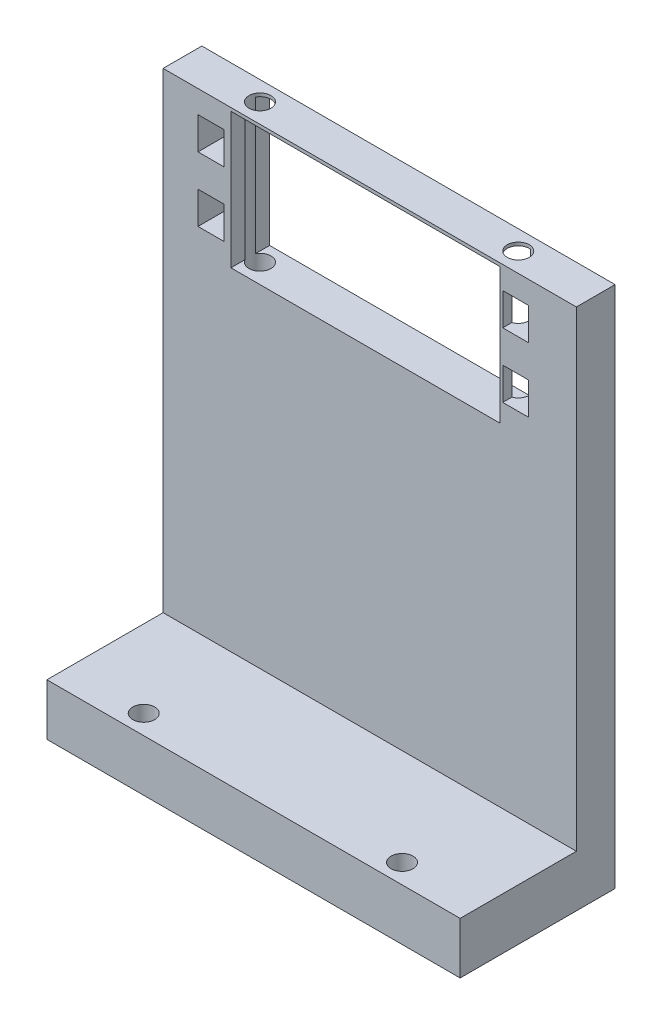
from build123d import *

# Parameters (mm, degrees)
SKETCH_1_W                                      = 64
SKETCH_1_H                                      = 8
SERVO_FOOT_DEPTH                                = 24
SKETCH_2_W                                      = 64
SKETCH_2_H                                      = 81
SERVO_FACE_PLATE_DEPTH                          = 6
MG995_BODY_WINDOW_REFERENCE_DEPTH               = 95.794514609
MG995_BODY_WINDOW_REFERENCE_DEPTH_BACK          = 95.794514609
SKETCH_3_W                                      = 41.7
SKETCH_3_H                                      = 21
MG995_47P2X10_REFERENCE_SLOTS_VERIFY_DEPTH      = 95.794514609
MG995_47P2X10_REFERENCE_SLOTS_VERIFY_DEPTH_BACK = 95.794514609
SKETCH_4_W                                      = 4
SKETCH_4_H                                      = 5
SERVO_FOOT_M3_DEPTH                             = 95.794514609
SERVO_FOOT_M3_DEPTH_BACK                        = 95.794514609
SKETCH_5_R                                      = 1.7


with BuildPart() as part:
    # Sketch 1 → Servo_foot (new body)
    with BuildSketch(Plane.XY):
        with Locations((11, 4)):
            Rectangle(SKETCH_1_W, SKETCH_1_H)
    extrude(amount=SERVO_FOOT_DEPTH)

    # Sketch 2 → Servo_face_plate (add)
    with BuildSketch(Plane.XY):
        with Locations((11, 40.5)):
            Rectangle(SKETCH_2_W, SKETCH_2_H)
    extrude(amount=SERVO_FACE_PLATE_DEPTH)

    # Sketch 3 → MG995_body_window_REFERENCE (cut, two sides: drawn at the far end of the back side and taken through both)
    with BuildSketch(Plane.XY.offset(-MG995_BODY_WINDOW_REFERENCE_DEPTH_BACK)):
        with Locations((10.35, 70)):
            Rectangle(SKETCH_3_W, SKETCH_3_H)
    extrude(amount=MG995_BODY_WINDOW_REFERENCE_DEPTH + MG995_BODY_WINDOW_REFERENCE_DEPTH_BACK, mode=Mode.SUBTRACT)

    # Sketch 4 → MG995_47p2x10_reference_slots_VERIFY (cut, two sides: drawn at the far end of the back side and taken through both)
    with BuildSketch(Plane.XY.offset(-MG995_47P2X10_REFERENCE_SLOTS_VERIFY_DEPTH_BACK)):
        with Locations((-13.6, 65)):
            Rectangle(SKETCH_4_W, SKETCH_4_H)
        with Locations((-13.6, 75)):
            Rectangle(SKETCH_4_W, SKETCH_4_H)
        with Locations((33.6, 65)):
            Rectangle(SKETCH_4_W, SKETCH_4_H)
        with Locations((33.6, 75)):
            Rectangle(SKETCH_4_W, SKETCH_4_H)
    extrude(amount=MG995_47P2X10_REFERENCE_SLOTS_VERIFY_DEPTH + MG995_47P2X10_REFERENCE_SLOTS_VERIFY_DEPTH_BACK, mode=Mode.SUBTRACT)

    # Sketch 5 → Servo_foot_M3 (cut, two sides: drawn at the far end of the back side and taken through both)
    with BuildSketch(Plane(origin=(0, 0, 0), x_dir=(1, 0, 0), z_dir=(0, 1, 0)).offset(-SERVO_FOOT_M3_DEPTH_BACK)):
        with Locations(Location((-9, -3, 0), (0, 0, 270))):
            Circle(SKETCH_5_R)
        with Locations(Location((-9, -21, 0), (0, 0, 270))):
            Circle(SKETCH_5_R)
        with Locations(Location((31, -3, 0), (0, 0, 270))):
            Circle(SKETCH_5_R)
        with Locations(Location((31, -21, 0), (0, 0, 270))):
            Circle(SKETCH_5_R)
    extrude(amount=SERVO_FOOT_M3_DEPTH + SERVO_FOOT_M3_DEPTH_BACK, mode=Mode.SUBTRACT)


solid = part.part
